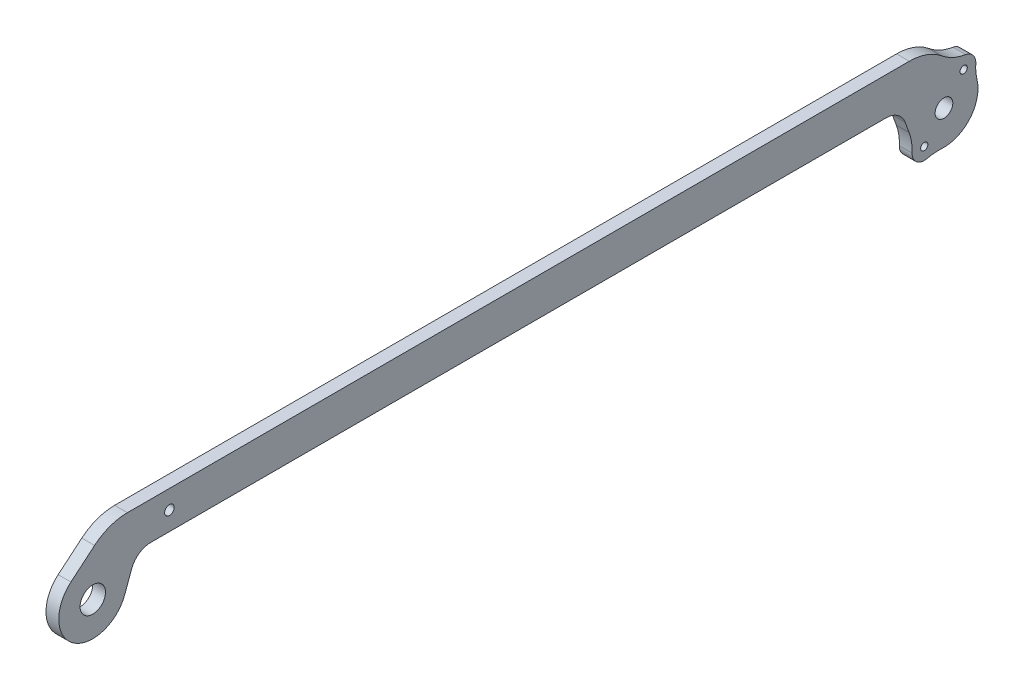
ISO-10303-21;
HEADER;
FILE_DESCRIPTION(('STEP AP214'),'2;1');
FILE_NAME('part.step','',(''),(''),'','','');
FILE_SCHEMA(('AUTOMOTIVE_DESIGN { 1 0 10303 214 1 1 1 1 }'));
ENDSEC;
DATA;
#1=APPLICATION_CONTEXT('core data for automotive mechanical design processes');
#2=APPLICATION_PROTOCOL_DEFINITION('international standard','automotive_design',2000,#1);
#3=PRODUCT_CONTEXT('',#1,'mechanical');
#4=PRODUCT('Part','Part','',(#3));
#5=PRODUCT_RELATED_PRODUCT_CATEGORY('part','',(#4));
#6=PRODUCT_DEFINITION_FORMATION('','',#4);
#7=PRODUCT_DEFINITION_CONTEXT('part definition',#1,'design');
#8=PRODUCT_DEFINITION('design','',#6,#7);
#9=PRODUCT_DEFINITION_SHAPE('','',#8);
#10=(LENGTH_UNIT() NAMED_UNIT(*) SI_UNIT(.MILLI.,.METRE.));
#11=(NAMED_UNIT(*) PLANE_ANGLE_UNIT() SI_UNIT($,.RADIAN.));
#12=(NAMED_UNIT(*) SI_UNIT($,.STERADIAN.) SOLID_ANGLE_UNIT());
#13=UNCERTAINTY_MEASURE_WITH_UNIT(LENGTH_MEASURE(1.E-05),#10,'distance_accuracy_value','');
#14=(GEOMETRIC_REPRESENTATION_CONTEXT(3) GLOBAL_UNCERTAINTY_ASSIGNED_CONTEXT((#13)) GLOBAL_UNIT_ASSIGNED_CONTEXT((#10,
#11,#12)) REPRESENTATION_CONTEXT('',''));
#15=CARTESIAN_POINT('',(0.,0.,0.));
#16=DIRECTION('',(0.,0.,1.));
#17=DIRECTION('',(1.,0.,0.));
#18=AXIS2_PLACEMENT_3D('',#15,#16,#17);
#19=CARTESIAN_POINT('',(4.7625,0.,-317.5));
#20=DIRECTION('',(-1.,0.,0.));
#21=DIRECTION('',(0.,0.,1.));
#22=AXIS2_PLACEMENT_3D('',#19,#20,#21);
#23=CYLINDRICAL_SURFACE('',#22,12.7);
#24=DIRECTION('',(1.,0.,0.));
#25=VECTOR('',#24,1.);
#26=CARTESIAN_POINT('',(-19.6871358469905,-12.677440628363,-316.743363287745));
#27=LINE('',#26,#25);
#28=CARTESIAN_POINT('',(0.,-12.677440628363,-316.743363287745));
#29=VERTEX_POINT('',#28);
#30=CARTESIAN_POINT('',(4.7625,-12.677440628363,-316.743363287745));
#31=VERTEX_POINT('',#30);
#32=EDGE_CURVE('E195',#29,#31,#27,.T.);
#33=ORIENTED_EDGE('',*,*,#32,.F.);
#34=CARTESIAN_POINT('',(0.,0.,-317.5));
#35=DIRECTION('',(1.,0.,0.));
#36=DIRECTION('',(0.,0.,-1.));
#37=AXIS2_PLACEMENT_3D('',#34,#35,#36);
#38=CIRCLE('',#37,12.7);
#39=CARTESIAN_POINT('',(0.,2.94655616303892,-329.853453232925));
#40=VERTEX_POINT('',#39);
#41=EDGE_CURVE('E289',#29,#40,#38,.T.);
#42=ORIENTED_EDGE('',*,*,#41,.T.);
#43=DIRECTION('',(1.,0.,0.));
#44=VECTOR('',#43,1.);
#45=CARTESIAN_POINT('',(-19.6871358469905,2.94655616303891,-329.853453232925));
#46=LINE('',#45,#44);
#47=CARTESIAN_POINT('',(4.7625,2.94655616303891,-329.853453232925));
#48=VERTEX_POINT('',#47);
#49=EDGE_CURVE('E227',#40,#48,#46,.T.);
#50=ORIENTED_EDGE('',*,*,#49,.T.);
#51=CARTESIAN_POINT('',(4.7625,0.,-317.5));
#52=DIRECTION('',(1.,0.,0.));
#53=DIRECTION('',(0.,0.,-1.));
#54=AXIS2_PLACEMENT_3D('',#51,#52,#53);
#55=CIRCLE('',#54,12.7);
#56=EDGE_CURVE('E270',#31,#48,#55,.T.);
#57=ORIENTED_EDGE('',*,*,#56,.F.);
#58=EDGE_LOOP('',(#33,#42,#50,#57));
#59=FACE_BOUND('',#58,.T.);
#60=ADVANCED_FACE('F60',(#59),#23,.T.);
#61=CARTESIAN_POINT('',(4.7625,0.,-21.6240923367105));
#62=DIRECTION('',(-1.,0.,0.));
#63=DIRECTION('',(0.,0.,1.));
#64=AXIS2_PLACEMENT_3D('',#61,#62,#63);
#65=PLANE('',#64);
#66=CARTESIAN_POINT('',(4.7625,14.605,-28.575));
#67=DIRECTION('',(1.,0.,0.));
#68=DIRECTION('',(0.,0.,-1.));
#69=AXIS2_PLACEMENT_3D('',#66,#67,#68);
#70=CIRCLE('',#69,1.778);
#71=CARTESIAN_POINT('',(4.7625,14.605,-30.353));
#72=VERTEX_POINT('',#71);
#73=EDGE_CURVE('E469',#72,#72,#70,.T.);
#74=ORIENTED_EDGE('',*,*,#73,.F.);
#75=EDGE_LOOP('',(#74));
#76=FACE_BOUND('',#75,.T.);
#77=CARTESIAN_POINT('',(4.7625,8.75588798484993,-324.847062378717));
#78=DIRECTION('',(1.,0.,0.));
#79=DIRECTION('',(0.,0.,-1.));
#80=AXIS2_PLACEMENT_3D('',#77,#78,#79);
#81=CIRCLE('',#80,1.35255000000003);
#82=CARTESIAN_POINT('',(4.7625,8.75588798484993,-326.199612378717));
#83=VERTEX_POINT('',#82);
#84=EDGE_CURVE('E215',#83,#83,#81,.T.);
#85=ORIENTED_EDGE('',*,*,#84,.F.);
#86=EDGE_LOOP('',(#85));
#87=FACE_BOUND('',#86,.T.);
#88=CARTESIAN_POINT('',(4.7625,-8.75588798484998,-310.152937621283));
#89=DIRECTION('',(1.,0.,0.));
#90=DIRECTION('',(0.,0.,-1.));
#91=AXIS2_PLACEMENT_3D('',#88,#89,#90);
#92=CIRCLE('',#91,1.35255000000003);
#93=CARTESIAN_POINT('',(4.7625,-8.75588798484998,-311.505487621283));
#94=VERTEX_POINT('',#93);
#95=EDGE_CURVE('E363',#94,#94,#92,.T.);
#96=ORIENTED_EDGE('',*,*,#95,.F.);
#97=EDGE_LOOP('',(#96));
#98=FACE_BOUND('',#97,.T.);
#99=DIRECTION('',(0.,0.,1.));
#100=VECTOR('',#99,1.);
#101=CARTESIAN_POINT('',(4.7625,21.59,-5.97226746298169));
#102=LINE('',#101,#100);
#103=CARTESIAN_POINT('',(4.7625,21.59,-304.59808975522));
#104=VERTEX_POINT('',#103);
#105=CARTESIAN_POINT('',(4.7625,21.59,-12.9059004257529));
#106=VERTEX_POINT('',#105);
#107=EDGE_CURVE('E272',#104,#106,#102,.T.);
#108=ORIENTED_EDGE('',*,*,#107,.T.);
#109=CARTESIAN_POINT('',(4.7625,2.54,-12.9059004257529));
#110=DIRECTION('',(-1.,0.,0.));
#111=DIRECTION('',(0.,0.,1.));
#112=AXIS2_PLACEMENT_3D('',#109,#110,#111);
#113=CIRCLE('',#112,19.05);
#114=CARTESIAN_POINT('',(4.7625,17.1331466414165,-0.660796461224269));
#115=VERTEX_POINT('',#114);
#116=EDGE_CURVE('E68',#106,#115,#113,.F.);
#117=ORIENTED_EDGE('',*,*,#116,.T.);
#118=DIRECTION('',(0.,-0.642787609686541,0.766044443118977));
#119=VECTOR('',#118,1.);
#120=CARTESIAN_POINT('',(4.7625,9.72876442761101,8.16340264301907));
#121=LINE('',#120,#119);
#122=CARTESIAN_POINT('',(4.7625,9.728764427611,8.16340264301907));
#123=VERTEX_POINT('',#122);
#124=EDGE_CURVE('E274',#115,#123,#121,.T.);
#125=ORIENTED_EDGE('',*,*,#124,.T.);
#126=CARTESIAN_POINT('',(4.7625,0.,0.));
#127=DIRECTION('',(1.,0.,0.));
#128=DIRECTION('',(0.,0.,-1.));
#129=AXIS2_PLACEMENT_3D('',#126,#127,#128);
#130=CIRCLE('',#129,12.7);
#131=CARTESIAN_POINT('',(4.7625,-4.343655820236,-11.934096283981));
#132=VERTEX_POINT('',#131);
#133=EDGE_CURVE('E276',#123,#132,#130,.T.);
#134=ORIENTED_EDGE('',*,*,#133,.T.);
#135=DIRECTION('',(0.,0.939692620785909,-0.342020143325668));
#136=VECTOR('',#135,1.);
#137=CARTESIAN_POINT('',(4.7625,-4.343655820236,-11.934096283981));
#138=LINE('',#137,#136);
#139=CARTESIAN_POINT('',(4.7625,2.6061934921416,-14.4636345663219));
#140=VERTEX_POINT('',#139);
#141=EDGE_CURVE('E278',#132,#140,#138,.T.);
#142=ORIENTED_EDGE('',*,*,#141,.T.);
#143=CARTESIAN_POINT('',(4.7625,0.,-21.6240923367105));
#144=DIRECTION('',(-1.,0.,0.));
#145=DIRECTION('',(0.,0.,1.));
#146=AXIS2_PLACEMENT_3D('',#143,#144,#145);
#147=CIRCLE('',#146,7.62);
#148=CARTESIAN_POINT('',(4.7625,7.62,-21.6240923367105));
#149=VERTEX_POINT('',#148);
#150=EDGE_CURVE('E259',#140,#149,#147,.T.);
#151=ORIENTED_EDGE('',*,*,#150,.T.);
#152=DIRECTION('',(0.,0.,-1.));
#153=VECTOR('',#152,1.);
#154=CARTESIAN_POINT('',(4.7625,7.62,-21.6240923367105));
#155=LINE('',#154,#153);
#156=CARTESIAN_POINT('',(4.7625,7.62000000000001,-295.875907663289));
#157=VERTEX_POINT('',#156);
#158=EDGE_CURVE('E262',#149,#157,#155,.T.);
#159=ORIENTED_EDGE('',*,*,#158,.T.);
#160=CARTESIAN_POINT('',(4.7625,0.,-295.875907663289));
#161=DIRECTION('',(-1.,0.,0.));
#162=DIRECTION('',(0.,0.,1.));
#163=AXIS2_PLACEMENT_3D('',#160,#161,#162);
#164=CIRCLE('',#163,7.62000000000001);
#165=CARTESIAN_POINT('',(4.7625,2.6061934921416,-303.036365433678));
#166=VERTEX_POINT('',#165);
#167=EDGE_CURVE('E265',#157,#166,#164,.T.);
#168=ORIENTED_EDGE('',*,*,#167,.T.);
#169=DIRECTION('',(0.,-0.939692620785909,-0.342020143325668));
#170=VECTOR('',#169,1.);
#171=CARTESIAN_POINT('',(4.7625,2.6061934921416,-303.036365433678));
#172=LINE('',#171,#170);
#173=CARTESIAN_POINT('',(4.7625,-1.39253114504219,-304.49178217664));
#174=VERTEX_POINT('',#173);
#175=EDGE_CURVE('E267',#166,#174,#172,.T.);
#176=ORIENTED_EDGE('',*,*,#175,.T.);
#177=CARTESIAN_POINT('',(4.7625,-7.90801487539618,-286.590637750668));
#178=DIRECTION('',(1.,0.,0.));
#179=DIRECTION('',(0.,0.,-1.));
#180=AXIS2_PLACEMENT_3D('',#177,#178,#179);
#181=CIRCLE('',#180,19.05);
#182=CARTESIAN_POINT('',(4.7625,-8.59307259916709,-305.628316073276));
#183=VERTEX_POINT('',#182);
#184=EDGE_CURVE('E206',#183,#174,#181,.T.);
#185=ORIENTED_EDGE('',*,*,#184,.F.);
#186=CARTESIAN_POINT('',(4.7625,-8.75588798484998,-310.152937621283));
#187=DIRECTION('',(1.,0.,0.));
#188=DIRECTION('',(0.,0.,-1.));
#189=AXIS2_PLACEMENT_3D('',#186,#187,#188);
#190=CIRCLE('',#189,4.52755000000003);
#191=CARTESIAN_POINT('',(4.7625,-13.1605714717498,-311.200540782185));
#192=VERTEX_POINT('',#191);
#193=EDGE_CURVE('E202',#183,#192,#190,.T.);
#194=ORIENTED_EDGE('',*,*,#193,.T.);
#195=CARTESIAN_POINT('',(4.7625,-31.6936015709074,-315.608408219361));
#196=DIRECTION('',(1.,0.,0.));
#197=DIRECTION('',(0.,0.,-1.));
#198=AXIS2_PLACEMENT_3D('',#195,#196,#197);
#199=CIRCLE('',#198,19.05);
#200=EDGE_CURVE('E212',#192,#31,#199,.F.);
#201=ORIENTED_EDGE('',*,*,#200,.T.);
#202=ORIENTED_EDGE('',*,*,#56,.T.);
#203=CARTESIAN_POINT('',(4.7625,7.36639040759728,-348.383633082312));
#204=DIRECTION('',(1.,0.,0.));
#205=DIRECTION('',(0.,0.,-1.));
#206=AXIS2_PLACEMENT_3D('',#203,#204,#205);
#207=CIRCLE('',#206,19.05);
#208=CARTESIAN_POINT('',(4.7625,8.48906553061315,-329.36674320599));
#209=VERTEX_POINT('',#208);
#210=EDGE_CURVE('E229',#209,#48,#207,.T.);
#211=ORIENTED_EDGE('',*,*,#210,.F.);
#212=CARTESIAN_POINT('',(4.7625,8.75588798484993,-324.847062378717));
#213=DIRECTION('',(1.,0.,0.));
#214=DIRECTION('',(0.,0.,-1.));
#215=AXIS2_PLACEMENT_3D('',#212,#213,#214);
#216=CIRCLE('',#215,4.52755000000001);
#217=CARTESIAN_POINT('',(4.7625,13.2210391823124,-325.596151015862));
#218=VERTEX_POINT('',#217);
#219=EDGE_CURVE('E224',#209,#218,#216,.T.);
#220=ORIENTED_EDGE('',*,*,#219,.T.);
#221=CARTESIAN_POINT('',(4.7625,32.0084916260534,-328.747996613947));
#222=DIRECTION('',(1.,0.,0.));
#223=DIRECTION('',(0.,0.,-1.));
#224=AXIS2_PLACEMENT_3D('',#221,#222,#223);
#225=CIRCLE('',#224,19.05);
#226=CARTESIAN_POINT('',(4.7625,17.2742458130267,-316.673043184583));
#227=VERTEX_POINT('',#226);
#228=EDGE_CURVE('E228',#218,#227,#225,.F.);
#229=ORIENTED_EDGE('',*,*,#228,.T.);
#230=CARTESIAN_POINT('',(4.7625,2.54000000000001,-304.59808975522));
#231=DIRECTION('',(-1.,0.,0.));
#232=DIRECTION('',(0.,0.,1.));
#233=AXIS2_PLACEMENT_3D('',#230,#231,#232);
#234=CIRCLE('',#233,19.05);
#235=EDGE_CURVE('E326',#227,#104,#234,.F.);
#236=ORIENTED_EDGE('',*,*,#235,.T.);
#237=EDGE_LOOP('',(#108,#117,#125,#134,#142,#151,#159,#168,#176,#185,#194,#201,#202,#211,#220,
#229,#236));
#238=FACE_BOUND('',#237,.T.);
#239=CARTESIAN_POINT('',(4.7625,0.,0.));
#240=DIRECTION('',(1.,0.,0.));
#241=DIRECTION('',(0.,0.,-1.));
#242=AXIS2_PLACEMENT_3D('',#239,#240,#241);
#243=CIRCLE('',#242,4.7371);
#244=CARTESIAN_POINT('',(4.7625,0.,4.7371));
#245=VERTEX_POINT('',#244);
#246=EDGE_CURVE('E253',#245,#245,#243,.T.);
#247=ORIENTED_EDGE('',*,*,#246,.F.);
#248=EDGE_LOOP('',(#247));
#249=FACE_BOUND('',#248,.T.);
#250=CARTESIAN_POINT('',(4.7625,0.,-317.5));
#251=DIRECTION('',(1.,0.,0.));
#252=DIRECTION('',(0.,0.,-1.));
#253=AXIS2_PLACEMENT_3D('',#250,#251,#252);
#254=CIRCLE('',#253,3.30200000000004);
#255=CARTESIAN_POINT('',(4.7625,0.,-314.198));
#256=VERTEX_POINT('',#255);
#257=EDGE_CURVE('E247',#256,#256,#254,.T.);
#258=ORIENTED_EDGE('',*,*,#257,.F.);
#259=EDGE_LOOP('',(#258));
#260=FACE_BOUND('',#259,.T.);
#261=ADVANCED_FACE('F330',(#76,#87,#98,#238,#249,#260),#65,.F.);
#262=CARTESIAN_POINT('',(0.,0.,-21.6240923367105));
#263=DIRECTION('',(-1.,0.,0.));
#264=DIRECTION('',(0.,0.,1.));
#265=AXIS2_PLACEMENT_3D('',#262,#263,#264);
#266=PLANE('',#265);
#267=CARTESIAN_POINT('',(0.,14.605,-28.575));
#268=DIRECTION('',(1.,0.,0.));
#269=DIRECTION('',(0.,0.,-1.));
#270=AXIS2_PLACEMENT_3D('',#267,#268,#269);
#271=CIRCLE('',#270,1.778);
#272=CARTESIAN_POINT('',(0.,14.605,-30.353));
#273=VERTEX_POINT('',#272);
#274=EDGE_CURVE('E460',#273,#273,#271,.T.);
#275=ORIENTED_EDGE('',*,*,#274,.T.);
#276=EDGE_LOOP('',(#275));
#277=FACE_BOUND('',#276,.T.);
#278=CARTESIAN_POINT('',(0.,8.75588798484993,-324.847062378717));
#279=DIRECTION('',(1.,0.,0.));
#280=DIRECTION('',(0.,0.,-1.));
#281=AXIS2_PLACEMENT_3D('',#278,#279,#280);
#282=CIRCLE('',#281,1.35255000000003);
#283=CARTESIAN_POINT('',(0.,8.75588798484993,-326.199612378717));
#284=VERTEX_POINT('',#283);
#285=EDGE_CURVE('E210',#284,#284,#282,.T.);
#286=ORIENTED_EDGE('',*,*,#285,.T.);
#287=EDGE_LOOP('',(#286));
#288=FACE_BOUND('',#287,.T.);
#289=CARTESIAN_POINT('',(0.,-8.75588798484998,-310.152937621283));
#290=DIRECTION('',(1.,0.,0.));
#291=DIRECTION('',(0.,0.,-1.));
#292=AXIS2_PLACEMENT_3D('',#289,#290,#291);
#293=CIRCLE('',#292,1.35255000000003);
#294=CARTESIAN_POINT('',(0.,-8.75588798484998,-311.505487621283));
#295=VERTEX_POINT('',#294);
#296=EDGE_CURVE('E464',#295,#295,#293,.T.);
#297=ORIENTED_EDGE('',*,*,#296,.T.);
#298=EDGE_LOOP('',(#297));
#299=FACE_BOUND('',#298,.T.);
#300=DIRECTION('',(0.,-0.642787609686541,0.766044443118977));
#301=VECTOR('',#300,1.);
#302=CARTESIAN_POINT('',(0.,9.72876442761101,8.16340264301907));
#303=LINE('',#302,#301);
#304=CARTESIAN_POINT('',(0.,17.1331466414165,-0.660796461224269));
#305=VERTEX_POINT('',#304);
#306=CARTESIAN_POINT('',(0.,9.728764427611,8.16340264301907));
#307=VERTEX_POINT('',#306);
#308=EDGE_CURVE('E293',#305,#307,#303,.T.);
#309=ORIENTED_EDGE('',*,*,#308,.F.);
#310=CARTESIAN_POINT('',(0.,2.54,-12.9059004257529));
#311=DIRECTION('',(-1.,0.,0.));
#312=DIRECTION('',(0.,0.,1.));
#313=AXIS2_PLACEMENT_3D('',#310,#311,#312);
#314=CIRCLE('',#313,19.05);
#315=CARTESIAN_POINT('',(0.,21.59,-12.9059004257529));
#316=VERTEX_POINT('',#315);
#317=EDGE_CURVE('E320',#305,#316,#314,.T.);
#318=ORIENTED_EDGE('',*,*,#317,.T.);
#319=DIRECTION('',(0.,0.,1.));
#320=VECTOR('',#319,1.);
#321=CARTESIAN_POINT('',(0.,21.59,-5.97226746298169));
#322=LINE('',#321,#320);
#323=CARTESIAN_POINT('',(0.,21.59,-304.59808975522));
#324=VERTEX_POINT('',#323);
#325=EDGE_CURVE('E291',#324,#316,#322,.T.);
#326=ORIENTED_EDGE('',*,*,#325,.F.);
#327=CARTESIAN_POINT('',(0.,2.54000000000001,-304.59808975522));
#328=DIRECTION('',(-1.,0.,0.));
#329=DIRECTION('',(0.,0.,1.));
#330=AXIS2_PLACEMENT_3D('',#327,#328,#329);
#331=CIRCLE('',#330,19.05);
#332=CARTESIAN_POINT('',(0.,17.2742458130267,-316.673043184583));
#333=VERTEX_POINT('',#332);
#334=EDGE_CURVE('E318',#324,#333,#331,.T.);
#335=ORIENTED_EDGE('',*,*,#334,.T.);
#336=CARTESIAN_POINT('',(0.,32.0084916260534,-328.747996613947));
#337=DIRECTION('',(-1.,0.,0.));
#338=DIRECTION('',(0.,0.,1.));
#339=AXIS2_PLACEMENT_3D('',#336,#337,#338);
#340=CIRCLE('',#339,19.05);
#341=CARTESIAN_POINT('',(0.,13.2210391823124,-325.596151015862));
#342=VERTEX_POINT('',#341);
#343=EDGE_CURVE('E235',#342,#333,#340,.T.);
#344=ORIENTED_EDGE('',*,*,#343,.F.);
#345=CARTESIAN_POINT('',(0.,8.75588798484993,-324.847062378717));
#346=DIRECTION('',(-1.,0.,0.));
#347=DIRECTION('',(0.,0.,1.));
#348=AXIS2_PLACEMENT_3D('',#345,#346,#347);
#349=CIRCLE('',#348,4.52755000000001);
#350=CARTESIAN_POINT('',(0.,8.48906553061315,-329.36674320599));
#351=VERTEX_POINT('',#350);
#352=EDGE_CURVE('E232',#351,#342,#349,.F.);
#353=ORIENTED_EDGE('',*,*,#352,.F.);
#354=CARTESIAN_POINT('',(0.,7.36639040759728,-348.383633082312));
#355=DIRECTION('',(-1.,0.,0.));
#356=DIRECTION('',(0.,0.,1.));
#357=AXIS2_PLACEMENT_3D('',#354,#355,#356);
#358=CIRCLE('',#357,19.05);
#359=EDGE_CURVE('E220',#351,#40,#358,.F.);
#360=ORIENTED_EDGE('',*,*,#359,.T.);
#361=ORIENTED_EDGE('',*,*,#41,.F.);
#362=CARTESIAN_POINT('',(0.,-31.6936015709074,-315.608408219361));
#363=DIRECTION('',(-1.,0.,0.));
#364=DIRECTION('',(0.,0.,1.));
#365=AXIS2_PLACEMENT_3D('',#362,#363,#364);
#366=CIRCLE('',#365,19.05);
#367=CARTESIAN_POINT('',(0.,-13.1605714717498,-311.200540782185));
#368=VERTEX_POINT('',#367);
#369=EDGE_CURVE('E192',#368,#29,#366,.T.);
#370=ORIENTED_EDGE('',*,*,#369,.F.);
#371=CARTESIAN_POINT('',(0.,-8.75588798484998,-310.152937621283));
#372=DIRECTION('',(-1.,0.,0.));
#373=DIRECTION('',(0.,0.,1.));
#374=AXIS2_PLACEMENT_3D('',#371,#372,#373);
#375=CIRCLE('',#374,4.52755000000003);
#376=CARTESIAN_POINT('',(0.,-8.59307259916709,-305.628316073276));
#377=VERTEX_POINT('',#376);
#378=EDGE_CURVE('E181',#377,#368,#375,.F.);
#379=ORIENTED_EDGE('',*,*,#378,.F.);
#380=CARTESIAN_POINT('',(0.,-7.90801487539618,-286.590637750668));
#381=DIRECTION('',(-1.,0.,0.));
#382=DIRECTION('',(0.,0.,1.));
#383=AXIS2_PLACEMENT_3D('',#380,#381,#382);
#384=CIRCLE('',#383,19.05);
#385=CARTESIAN_POINT('',(0.,-1.39253114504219,-304.49178217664));
#386=VERTEX_POINT('',#385);
#387=EDGE_CURVE('E188',#377,#386,#384,.F.);
#388=ORIENTED_EDGE('',*,*,#387,.T.);
#389=DIRECTION('',(0.,-0.939692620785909,-0.342020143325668));
#390=VECTOR('',#389,1.);
#391=CARTESIAN_POINT('',(0.,2.6061934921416,-303.036365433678));
#392=LINE('',#391,#390);
#393=CARTESIAN_POINT('',(0.,2.6061934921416,-303.036365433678));
#394=VERTEX_POINT('',#393);
#395=EDGE_CURVE('E287',#394,#386,#392,.T.);
#396=ORIENTED_EDGE('',*,*,#395,.F.);
#397=CARTESIAN_POINT('',(0.,0.,-295.875907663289));
#398=DIRECTION('',(-1.,0.,0.));
#399=DIRECTION('',(0.,0.,1.));
#400=AXIS2_PLACEMENT_3D('',#397,#398,#399);
#401=CIRCLE('',#400,7.62000000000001);
#402=CARTESIAN_POINT('',(0.,7.62000000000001,-295.875907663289));
#403=VERTEX_POINT('',#402);
#404=EDGE_CURVE('E285',#403,#394,#401,.T.);
#405=ORIENTED_EDGE('',*,*,#404,.F.);
#406=DIRECTION('',(0.,0.,-1.));
#407=VECTOR('',#406,1.);
#408=CARTESIAN_POINT('',(0.,7.62,-21.6240923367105));
#409=LINE('',#408,#407);
#410=CARTESIAN_POINT('',(0.,7.62,-21.6240923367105));
#411=VERTEX_POINT('',#410);
#412=EDGE_CURVE('E283',#411,#403,#409,.T.);
#413=ORIENTED_EDGE('',*,*,#412,.F.);
#414=CARTESIAN_POINT('',(0.,0.,-21.6240923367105));
#415=DIRECTION('',(-1.,0.,0.));
#416=DIRECTION('',(0.,0.,1.));
#417=AXIS2_PLACEMENT_3D('',#414,#415,#416);
#418=CIRCLE('',#417,7.62);
#419=CARTESIAN_POINT('',(0.,2.6061934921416,-14.4636345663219));
#420=VERTEX_POINT('',#419);
#421=EDGE_CURVE('E256',#420,#411,#418,.T.);
#422=ORIENTED_EDGE('',*,*,#421,.F.);
#423=DIRECTION('',(0.,0.939692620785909,-0.342020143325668));
#424=VECTOR('',#423,1.);
#425=CARTESIAN_POINT('',(0.,-4.343655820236,-11.934096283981));
#426=LINE('',#425,#424);
#427=CARTESIAN_POINT('',(0.,-4.343655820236,-11.934096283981));
#428=VERTEX_POINT('',#427);
#429=EDGE_CURVE('E263',#428,#420,#426,.T.);
#430=ORIENTED_EDGE('',*,*,#429,.F.);
#431=CARTESIAN_POINT('',(0.,0.,0.));
#432=DIRECTION('',(1.,0.,0.));
#433=DIRECTION('',(0.,0.,-1.));
#434=AXIS2_PLACEMENT_3D('',#431,#432,#433);
#435=CIRCLE('',#434,12.7);
#436=EDGE_CURVE('E295',#307,#428,#435,.T.);
#437=ORIENTED_EDGE('',*,*,#436,.F.);
#438=EDGE_LOOP('',(#309,#318,#326,#335,#344,#353,#360,#361,#370,#379,#388,#396,#405,#413,#422,
#430,#437));
#439=FACE_BOUND('',#438,.T.);
#440=CARTESIAN_POINT('',(0.,0.,0.));
#441=DIRECTION('',(1.,0.,0.));
#442=DIRECTION('',(0.,0.,-1.));
#443=AXIS2_PLACEMENT_3D('',#440,#441,#442);
#444=CIRCLE('',#443,4.7371);
#445=CARTESIAN_POINT('',(0.,0.,4.7371));
#446=VERTEX_POINT('',#445);
#447=EDGE_CURVE('E250',#446,#446,#444,.T.);
#448=ORIENTED_EDGE('',*,*,#447,.T.);
#449=EDGE_LOOP('',(#448));
#450=FACE_BOUND('',#449,.T.);
#451=CARTESIAN_POINT('',(0.,0.,-317.5));
#452=DIRECTION('',(1.,0.,0.));
#453=DIRECTION('',(0.,0.,-1.));
#454=AXIS2_PLACEMENT_3D('',#451,#452,#453);
#455=CIRCLE('',#454,3.30200000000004);
#456=CARTESIAN_POINT('',(0.,0.,-314.198));
#457=VERTEX_POINT('',#456);
#458=EDGE_CURVE('E237',#457,#457,#455,.T.);
#459=ORIENTED_EDGE('',*,*,#458,.T.);
#460=EDGE_LOOP('',(#459));
#461=FACE_BOUND('',#460,.T.);
#462=ADVANCED_FACE('F184',(#277,#288,#299,#439,#450,#461),#266,.T.);
#463=CARTESIAN_POINT('',(4.7625,0.,-21.6240923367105));
#464=DIRECTION('',(-1.,0.,0.));
#465=DIRECTION('',(0.,0.,1.));
#466=AXIS2_PLACEMENT_3D('',#463,#464,#465);
#467=CYLINDRICAL_SURFACE('',#466,7.62);
#468=ORIENTED_EDGE('',*,*,#421,.T.);
#469=DIRECTION('',(-1.,0.,0.));
#470=VECTOR('',#469,1.);
#471=CARTESIAN_POINT('',(4.7625,7.62,-21.6240923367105));
#472=LINE('',#471,#470);
#473=EDGE_CURVE('E312',#149,#411,#472,.T.);
#474=ORIENTED_EDGE('',*,*,#473,.F.);
#475=ORIENTED_EDGE('',*,*,#150,.F.);
#476=DIRECTION('',(-1.,0.,0.));
#477=VECTOR('',#476,1.);
#478=CARTESIAN_POINT('',(4.7625,2.6061934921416,-14.4636345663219));
#479=LINE('',#478,#477);
#480=EDGE_CURVE('E280',#140,#420,#479,.T.);
#481=ORIENTED_EDGE('',*,*,#480,.T.);
#482=EDGE_LOOP('',(#468,#474,#475,#481));
#483=FACE_BOUND('',#482,.T.);
#484=ADVANCED_FACE('F381',(#483),#467,.F.);
#485=CARTESIAN_POINT('',(4.7625,7.62,-21.6240923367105));
#486=DIRECTION('',(0.,1.,0.));
#487=DIRECTION('',(0.,0.,1.));
#488=AXIS2_PLACEMENT_3D('',#485,#486,#487);
#489=PLANE('',#488);
#490=ORIENTED_EDGE('',*,*,#412,.T.);
#491=DIRECTION('',(-1.,0.,0.));
#492=VECTOR('',#491,1.);
#493=CARTESIAN_POINT('',(4.7625,7.62000000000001,-295.875907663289));
#494=LINE('',#493,#492);
#495=EDGE_CURVE('E309',#157,#403,#494,.T.);
#496=ORIENTED_EDGE('',*,*,#495,.F.);
#497=ORIENTED_EDGE('',*,*,#158,.F.);
#498=ORIENTED_EDGE('',*,*,#473,.T.);
#499=EDGE_LOOP('',(#490,#496,#497,#498));
#500=FACE_BOUND('',#499,.T.);
#501=ADVANCED_FACE('F378',(#500),#489,.F.);
#502=CARTESIAN_POINT('',(4.7625,0.,-295.875907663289));
#503=DIRECTION('',(-1.,0.,0.));
#504=DIRECTION('',(0.,0.,1.));
#505=AXIS2_PLACEMENT_3D('',#502,#503,#504);
#506=CYLINDRICAL_SURFACE('',#505,7.62000000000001);
#507=ORIENTED_EDGE('',*,*,#404,.T.);
#508=DIRECTION('',(-1.,0.,0.));
#509=VECTOR('',#508,1.);
#510=CARTESIAN_POINT('',(4.7625,2.6061934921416,-303.036365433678));
#511=LINE('',#510,#509);
#512=EDGE_CURVE('E306',#166,#394,#511,.T.);
#513=ORIENTED_EDGE('',*,*,#512,.F.);
#514=ORIENTED_EDGE('',*,*,#167,.F.);
#515=ORIENTED_EDGE('',*,*,#495,.T.);
#516=EDGE_LOOP('',(#507,#513,#514,#515));
#517=FACE_BOUND('',#516,.T.);
#518=ADVANCED_FACE('F372',(#517),#506,.F.);
#519=CARTESIAN_POINT('',(4.7625,2.6061934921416,-303.036365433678));
#520=DIRECTION('',(0.,0.342020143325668,-0.939692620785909));
#521=DIRECTION('',(0.,0.939692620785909,0.342020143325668));
#522=AXIS2_PLACEMENT_3D('',#519,#520,#521);
#523=PLANE('',#522);
#524=ORIENTED_EDGE('',*,*,#395,.T.);
#525=DIRECTION('',(1.,0.,0.));
#526=VECTOR('',#525,1.);
#527=CARTESIAN_POINT('',(-19.6871358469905,-1.39253114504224,-304.49178217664));
#528=LINE('',#527,#526);
#529=EDGE_CURVE('E209',#386,#174,#528,.T.);
#530=ORIENTED_EDGE('',*,*,#529,.T.);
#531=ORIENTED_EDGE('',*,*,#175,.F.);
#532=ORIENTED_EDGE('',*,*,#512,.T.);
#533=EDGE_LOOP('',(#524,#530,#531,#532));
#534=FACE_BOUND('',#533,.T.);
#535=ADVANCED_FACE('F367',(#534),#523,.F.);
#536=CARTESIAN_POINT('',(4.7625,21.59,-5.97226746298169));
#537=DIRECTION('',(0.,-1.,0.));
#538=DIRECTION('',(0.,0.,-1.));
#539=AXIS2_PLACEMENT_3D('',#536,#537,#538);
#540=PLANE('',#539);
#541=ORIENTED_EDGE('',*,*,#325,.T.);
#542=DIRECTION('',(-1.,0.,0.));
#543=VECTOR('',#542,1.);
#544=CARTESIAN_POINT('',(4.7625,21.59,-12.9059004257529));
#545=LINE('',#544,#543);
#546=EDGE_CURVE('E81',#316,#106,#545,.F.);
#547=ORIENTED_EDGE('',*,*,#546,.T.);
#548=ORIENTED_EDGE('',*,*,#107,.F.);
#549=DIRECTION('',(-1.,0.,0.));
#550=VECTOR('',#549,1.);
#551=CARTESIAN_POINT('',(0.,21.59,-304.59808975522));
#552=LINE('',#551,#550);
#553=EDGE_CURVE('E322',#104,#324,#552,.T.);
#554=ORIENTED_EDGE('',*,*,#553,.T.);
#555=EDGE_LOOP('',(#541,#547,#548,#554));
#556=FACE_BOUND('',#555,.T.);
#557=ADVANCED_FACE('F341',(#556),#540,.F.);
#558=CARTESIAN_POINT('',(4.7625,9.72876442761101,8.16340264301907));
#559=DIRECTION('',(0.,-0.766044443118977,-0.642787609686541));
#560=DIRECTION('',(0.,0.642787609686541,-0.766044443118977));
#561=AXIS2_PLACEMENT_3D('',#558,#559,#560);
#562=PLANE('',#561);
#563=ORIENTED_EDGE('',*,*,#124,.F.);
#564=DIRECTION('',(-1.,0.,0.));
#565=VECTOR('',#564,1.);
#566=CARTESIAN_POINT('',(4.7625,17.1331466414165,-0.660796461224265));
#567=LINE('',#566,#565);
#568=EDGE_CURVE('E315',#115,#305,#567,.T.);
#569=ORIENTED_EDGE('',*,*,#568,.T.);
#570=ORIENTED_EDGE('',*,*,#308,.T.);
#571=DIRECTION('',(-1.,0.,0.));
#572=VECTOR('',#571,1.);
#573=CARTESIAN_POINT('',(4.7625,9.728764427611,8.16340264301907));
#574=LINE('',#573,#572);
#575=EDGE_CURVE('E303',#123,#307,#574,.T.);
#576=ORIENTED_EDGE('',*,*,#575,.F.);
#577=EDGE_LOOP('',(#563,#569,#570,#576));
#578=FACE_BOUND('',#577,.T.);
#579=ADVANCED_FACE('F336',(#578),#562,.F.);
#580=CARTESIAN_POINT('',(4.7625,0.,0.));
#581=DIRECTION('',(-1.,0.,0.));
#582=DIRECTION('',(0.,0.,1.));
#583=AXIS2_PLACEMENT_3D('',#580,#581,#582);
#584=CYLINDRICAL_SURFACE('',#583,12.7);
#585=ORIENTED_EDGE('',*,*,#436,.T.);
#586=DIRECTION('',(-1.,0.,0.));
#587=VECTOR('',#586,1.);
#588=CARTESIAN_POINT('',(4.7625,-4.343655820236,-11.934096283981));
#589=LINE('',#588,#587);
#590=EDGE_CURVE('E300',#132,#428,#589,.T.);
#591=ORIENTED_EDGE('',*,*,#590,.F.);
#592=ORIENTED_EDGE('',*,*,#133,.F.);
#593=ORIENTED_EDGE('',*,*,#575,.T.);
#594=EDGE_LOOP('',(#585,#591,#592,#593));
#595=FACE_BOUND('',#594,.T.);
#596=ADVANCED_FACE('F388',(#595),#584,.T.);
#597=CARTESIAN_POINT('',(4.7625,-4.343655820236,-11.934096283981));
#598=DIRECTION('',(0.,0.342020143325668,0.939692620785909));
#599=DIRECTION('',(0.,-0.939692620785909,0.342020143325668));
#600=AXIS2_PLACEMENT_3D('',#597,#598,#599);
#601=PLANE('',#600);
#602=ORIENTED_EDGE('',*,*,#429,.T.);
#603=ORIENTED_EDGE('',*,*,#480,.F.);
#604=ORIENTED_EDGE('',*,*,#141,.F.);
#605=ORIENTED_EDGE('',*,*,#590,.T.);
#606=EDGE_LOOP('',(#602,#603,#604,#605));
#607=FACE_BOUND('',#606,.T.);
#608=ADVANCED_FACE('F385',(#607),#601,.F.);
#609=CARTESIAN_POINT('',(4.7625,0.,0.));
#610=DIRECTION('',(-1.,0.,0.));
#611=DIRECTION('',(0.,0.,1.));
#612=AXIS2_PLACEMENT_3D('',#609,#610,#611);
#613=CYLINDRICAL_SURFACE('',#612,4.7371);
#614=CARTESIAN_POINT('',(4.7625,0.,4.7371));
#615=CARTESIAN_POINT('',(4.712890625,0.,4.7371));
#616=CARTESIAN_POINT('',(4.66328125,0.,4.7371));
#617=CARTESIAN_POINT('',(4.5640625,0.,4.7371));
#618=CARTESIAN_POINT('',(4.514453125,0.,4.7371));
#619=CARTESIAN_POINT('',(4.415234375,0.,4.7371));
#620=CARTESIAN_POINT('',(4.365625,0.,4.7371));
#621=CARTESIAN_POINT('',(4.26640625,0.,4.7371));
#622=CARTESIAN_POINT('',(4.216796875,0.,4.7371));
#623=CARTESIAN_POINT('',(4.117578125,0.,4.7371));
#624=CARTESIAN_POINT('',(4.06796875,0.,4.7371));
#625=CARTESIAN_POINT('',(3.96875,0.,4.7371));
#626=CARTESIAN_POINT('',(3.919140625,0.,4.7371));
#627=CARTESIAN_POINT('',(3.819921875,0.,4.7371));
#628=CARTESIAN_POINT('',(3.7703125,0.,4.7371));
#629=CARTESIAN_POINT('',(3.67109375,0.,4.7371));
#630=CARTESIAN_POINT('',(3.621484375,0.,4.7371));
#631=CARTESIAN_POINT('',(3.522265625,0.,4.7371));
#632=CARTESIAN_POINT('',(3.47265625,0.,4.7371));
#633=CARTESIAN_POINT('',(3.3734375,0.,4.7371));
#634=CARTESIAN_POINT('',(3.323828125,0.,4.7371));
#635=CARTESIAN_POINT('',(3.224609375,0.,4.7371));
#636=CARTESIAN_POINT('',(3.175,0.,4.7371));
#637=CARTESIAN_POINT('',(3.07578125,0.,4.7371));
#638=CARTESIAN_POINT('',(3.026171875,0.,4.7371));
#639=CARTESIAN_POINT('',(2.926953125,0.,4.7371));
#640=CARTESIAN_POINT('',(2.87734375,0.,4.7371));
#641=CARTESIAN_POINT('',(2.778125,0.,4.7371));
#642=CARTESIAN_POINT('',(2.728515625,0.,4.7371));
#643=CARTESIAN_POINT('',(2.629296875,0.,4.7371));
#644=CARTESIAN_POINT('',(2.5796875,0.,4.7371));
#645=CARTESIAN_POINT('',(2.48046875,0.,4.7371));
#646=CARTESIAN_POINT('',(2.430859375,0.,4.7371));
#647=CARTESIAN_POINT('',(2.331640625,0.,4.7371));
#648=CARTESIAN_POINT('',(2.28203125,0.,4.7371));
#649=CARTESIAN_POINT('',(2.1828125,0.,4.7371));
#650=CARTESIAN_POINT('',(2.133203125,0.,4.7371));
#651=CARTESIAN_POINT('',(2.033984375,0.,4.7371));
#652=CARTESIAN_POINT('',(1.984375,0.,4.7371));
#653=CARTESIAN_POINT('',(1.88515625,0.,4.7371));
#654=CARTESIAN_POINT('',(1.835546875,0.,4.7371));
#655=CARTESIAN_POINT('',(1.736328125,0.,4.7371));
#656=CARTESIAN_POINT('',(1.68671875,0.,4.7371));
#657=CARTESIAN_POINT('',(1.5875,0.,4.7371));
#658=CARTESIAN_POINT('',(1.537890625,0.,4.7371));
#659=CARTESIAN_POINT('',(1.438671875,0.,4.7371));
#660=CARTESIAN_POINT('',(1.3890625,0.,4.7371));
#661=CARTESIAN_POINT('',(1.28984375,0.,4.7371));
#662=CARTESIAN_POINT('',(1.240234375,0.,4.7371));
#663=CARTESIAN_POINT('',(1.141015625,0.,4.7371));
#664=CARTESIAN_POINT('',(1.09140625,0.,4.7371));
#665=CARTESIAN_POINT('',(0.992187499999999,0.,4.7371));
#666=CARTESIAN_POINT('',(0.942578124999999,0.,4.7371));
#667=CARTESIAN_POINT('',(0.843359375,0.,4.7371));
#668=CARTESIAN_POINT('',(0.79375,0.,4.7371));
#669=CARTESIAN_POINT('',(0.69453125,0.,4.7371));
#670=CARTESIAN_POINT('',(0.644921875,0.,4.7371));
#671=CARTESIAN_POINT('',(0.545703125,0.,4.7371));
#672=CARTESIAN_POINT('',(0.49609375,0.,4.7371));
#673=CARTESIAN_POINT('',(0.396875,0.,4.7371));
#674=CARTESIAN_POINT('',(0.347265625,0.,4.7371));
#675=CARTESIAN_POINT('',(0.248046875,0.,4.7371));
#676=CARTESIAN_POINT('',(0.1984375,0.,4.7371));
#677=CARTESIAN_POINT('',(0.09921875,0.,4.7371));
#678=CARTESIAN_POINT('',(0.049609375,0.,4.7371));
#679=CARTESIAN_POINT('',(0.,0.,4.7371));
#680=B_SPLINE_CURVE_WITH_KNOTS('',3,(#614,#615,#616,#617,#618,#619,#620,#621,#622,#623,#624,
#625,#626,#627,#628,#629,#630,#631,#632,#633,#634,#635,#636,#637,#638,#639,#640,#641,#642,#643,
#644,#645,#646,#647,#648,#649,#650,#651,#652,#653,#654,#655,#656,#657,#658,#659,#660,#661,#662,
#663,#664,#665,#666,#667,#668,#669,#670,#671,#672,#673,#674,#675,#676,#677,#678,#679),
.UNSPECIFIED.,.F.,.F.,(4,2,2,2,2,2,2,2,2,2,2,2,2,2,2,2,2,2,2,2,2,2,2,2,2,2,2,2,2,2,2,2,4),(0.,
0.148828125,0.29765625,0.446484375,0.5953125,0.744140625,0.892968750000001,1.041796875,1.190625,
1.339453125,1.48828125,1.637109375,1.7859375,1.934765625,2.08359375,2.232421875,2.38125,
2.530078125,2.67890625,2.827734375,2.9765625,3.125390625,3.27421875,3.423046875,3.571875,
3.720703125,3.86953125,4.018359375,4.1671875,4.316015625,4.46484375,4.613671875,4.7625),.UNSPECIFIED.);
#681=EDGE_CURVE('BSEAM395',#245,#446,#680,.T.);
#682=ORIENTED_EDGE('',*,*,#246,.T.);
#683=ORIENTED_EDGE('',*,*,#447,.F.);
#684=ORIENTED_EDGE('',*,*,#681,.T.);
#685=ORIENTED_EDGE('',*,*,#681,.F.);
#686=EDGE_LOOP('',(#682,#684,#683,#685));
#687=FACE_BOUND('',#686,.T.);
#688=ADVANCED_FACE('F395',(#687),#613,.F.);
#689=CARTESIAN_POINT('',(4.7625,0.,-317.5));
#690=DIRECTION('',(-1.,0.,0.));
#691=DIRECTION('',(0.,0.,1.));
#692=AXIS2_PLACEMENT_3D('',#689,#690,#691);
#693=CYLINDRICAL_SURFACE('',#692,3.30200000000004);
#694=CARTESIAN_POINT('',(4.7625,0.,-314.198));
#695=CARTESIAN_POINT('',(4.712890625,0.,-314.198));
#696=CARTESIAN_POINT('',(4.66328125,0.,-314.198));
#697=CARTESIAN_POINT('',(4.5640625,0.,-314.198));
#698=CARTESIAN_POINT('',(4.514453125,0.,-314.198));
#699=CARTESIAN_POINT('',(4.415234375,0.,-314.198));
#700=CARTESIAN_POINT('',(4.365625,0.,-314.198));
#701=CARTESIAN_POINT('',(4.26640625,0.,-314.198));
#702=CARTESIAN_POINT('',(4.216796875,0.,-314.198));
#703=CARTESIAN_POINT('',(4.117578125,0.,-314.198));
#704=CARTESIAN_POINT('',(4.06796875,0.,-314.198));
#705=CARTESIAN_POINT('',(3.96875,0.,-314.198));
#706=CARTESIAN_POINT('',(3.919140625,0.,-314.198));
#707=CARTESIAN_POINT('',(3.819921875,0.,-314.198));
#708=CARTESIAN_POINT('',(3.7703125,0.,-314.198));
#709=CARTESIAN_POINT('',(3.67109375,0.,-314.198));
#710=CARTESIAN_POINT('',(3.621484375,0.,-314.198));
#711=CARTESIAN_POINT('',(3.522265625,0.,-314.198));
#712=CARTESIAN_POINT('',(3.47265625,0.,-314.198));
#713=CARTESIAN_POINT('',(3.3734375,0.,-314.198));
#714=CARTESIAN_POINT('',(3.323828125,0.,-314.198));
#715=CARTESIAN_POINT('',(3.224609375,0.,-314.198));
#716=CARTESIAN_POINT('',(3.175,0.,-314.198));
#717=CARTESIAN_POINT('',(3.07578125,0.,-314.198));
#718=CARTESIAN_POINT('',(3.026171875,0.,-314.198));
#719=CARTESIAN_POINT('',(2.926953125,0.,-314.198));
#720=CARTESIAN_POINT('',(2.87734375,0.,-314.198));
#721=CARTESIAN_POINT('',(2.778125,0.,-314.198));
#722=CARTESIAN_POINT('',(2.728515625,0.,-314.198));
#723=CARTESIAN_POINT('',(2.629296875,0.,-314.198));
#724=CARTESIAN_POINT('',(2.5796875,0.,-314.198));
#725=CARTESIAN_POINT('',(2.48046875,0.,-314.198));
#726=CARTESIAN_POINT('',(2.430859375,0.,-314.198));
#727=CARTESIAN_POINT('',(2.331640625,0.,-314.198));
#728=CARTESIAN_POINT('',(2.28203125,0.,-314.198));
#729=CARTESIAN_POINT('',(2.1828125,0.,-314.198));
#730=CARTESIAN_POINT('',(2.133203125,0.,-314.198));
#731=CARTESIAN_POINT('',(2.033984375,0.,-314.198));
#732=CARTESIAN_POINT('',(1.984375,0.,-314.198));
#733=CARTESIAN_POINT('',(1.88515625,0.,-314.198));
#734=CARTESIAN_POINT('',(1.835546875,0.,-314.198));
#735=CARTESIAN_POINT('',(1.736328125,0.,-314.198));
#736=CARTESIAN_POINT('',(1.68671875,0.,-314.198));
#737=CARTESIAN_POINT('',(1.5875,0.,-314.198));
#738=CARTESIAN_POINT('',(1.537890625,0.,-314.198));
#739=CARTESIAN_POINT('',(1.438671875,0.,-314.198));
#740=CARTESIAN_POINT('',(1.3890625,0.,-314.198));
#741=CARTESIAN_POINT('',(1.28984375,0.,-314.198));
#742=CARTESIAN_POINT('',(1.240234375,0.,-314.198));
#743=CARTESIAN_POINT('',(1.141015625,0.,-314.198));
#744=CARTESIAN_POINT('',(1.09140625,0.,-314.198));
#745=CARTESIAN_POINT('',(0.9921875,0.,-314.198));
#746=CARTESIAN_POINT('',(0.942578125,0.,-314.198));
#747=CARTESIAN_POINT('',(0.843359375,0.,-314.198));
#748=CARTESIAN_POINT('',(0.79375,0.,-314.198));
#749=CARTESIAN_POINT('',(0.69453125,0.,-314.198));
#750=CARTESIAN_POINT('',(0.644921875,0.,-314.198));
#751=CARTESIAN_POINT('',(0.545703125,0.,-314.198));
#752=CARTESIAN_POINT('',(0.49609375,0.,-314.198));
#753=CARTESIAN_POINT('',(0.396875,0.,-314.198));
#754=CARTESIAN_POINT('',(0.347265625,0.,-314.198));
#755=CARTESIAN_POINT('',(0.248046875,0.,-314.198));
#756=CARTESIAN_POINT('',(0.1984375,0.,-314.198));
#757=CARTESIAN_POINT('',(0.09921875,0.,-314.198));
#758=CARTESIAN_POINT('',(0.049609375,0.,-314.198));
#759=CARTESIAN_POINT('',(0.,0.,-314.198));
#760=B_SPLINE_CURVE_WITH_KNOTS('',3,(#694,#695,#696,#697,#698,#699,#700,#701,#702,#703,#704,
#705,#706,#707,#708,#709,#710,#711,#712,#713,#714,#715,#716,#717,#718,#719,#720,#721,#722,#723,
#724,#725,#726,#727,#728,#729,#730,#731,#732,#733,#734,#735,#736,#737,#738,#739,#740,#741,#742,
#743,#744,#745,#746,#747,#748,#749,#750,#751,#752,#753,#754,#755,#756,#757,#758,#759),
.UNSPECIFIED.,.F.,.F.,(4,2,2,2,2,2,2,2,2,2,2,2,2,2,2,2,2,2,2,2,2,2,2,2,2,2,2,2,2,2,2,2,4),(0.,
0.148828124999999,0.297656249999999,0.446484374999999,0.595312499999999,0.744140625,0.89296875,
1.041796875,1.190625,1.339453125,1.48828125,1.637109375,1.7859375,1.934765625,2.08359375,
2.232421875,2.38125,2.530078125,2.67890625,2.827734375,2.9765625,3.125390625,3.27421875,
3.423046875,3.571875,3.720703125,3.86953125,4.018359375,4.1671875,4.316015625,4.46484375,
4.613671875,4.7625),.UNSPECIFIED.);
#761=EDGE_CURVE('BSEAM446',#256,#457,#760,.T.);
#762=ORIENTED_EDGE('',*,*,#257,.T.);
#763=ORIENTED_EDGE('',*,*,#458,.F.);
#764=ORIENTED_EDGE('',*,*,#761,.T.);
#765=ORIENTED_EDGE('',*,*,#761,.F.);
#766=EDGE_LOOP('',(#762,#764,#763,#765));
#767=FACE_BOUND('',#766,.T.);
#768=ADVANCED_FACE('F446',(#767),#693,.F.);
#769=CARTESIAN_POINT('',(-19.6871358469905,7.36639040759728,-348.383633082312));
#770=DIRECTION('',(1.,0.,0.));
#771=DIRECTION('',(0.,0.,-1.));
#772=AXIS2_PLACEMENT_3D('',#769,#770,#771);
#773=CYLINDRICAL_SURFACE('',#772,19.05);
#774=ORIENTED_EDGE('',*,*,#359,.F.);
#775=DIRECTION('',(1.,0.,0.));
#776=VECTOR('',#775,1.);
#777=CARTESIAN_POINT('',(-19.6871358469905,8.48906553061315,-329.36674320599));
#778=LINE('',#777,#776);
#779=EDGE_CURVE('E233',#351,#209,#778,.T.);
#780=ORIENTED_EDGE('',*,*,#779,.T.);
#781=ORIENTED_EDGE('',*,*,#210,.T.);
#782=ORIENTED_EDGE('',*,*,#49,.F.);
#783=EDGE_LOOP('',(#774,#780,#781,#782));
#784=FACE_BOUND('',#783,.T.);
#785=ADVANCED_FACE('F354',(#784),#773,.F.);
#786=CARTESIAN_POINT('',(-19.6871358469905,8.75588798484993,-324.847062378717));
#787=DIRECTION('',(1.,0.,0.));
#788=DIRECTION('',(0.,0.,-1.));
#789=AXIS2_PLACEMENT_3D('',#786,#787,#788);
#790=CYLINDRICAL_SURFACE('',#789,4.52755000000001);
#791=ORIENTED_EDGE('',*,*,#779,.F.);
#792=ORIENTED_EDGE('',*,*,#352,.T.);
#793=DIRECTION('',(1.,0.,0.));
#794=VECTOR('',#793,1.);
#795=CARTESIAN_POINT('',(-19.6871358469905,13.2210391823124,-325.596151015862));
#796=LINE('',#795,#794);
#797=EDGE_CURVE('E238',#342,#218,#796,.T.);
#798=ORIENTED_EDGE('',*,*,#797,.T.);
#799=ORIENTED_EDGE('',*,*,#219,.F.);
#800=EDGE_LOOP('',(#791,#792,#798,#799));
#801=FACE_BOUND('',#800,.T.);
#802=ADVANCED_FACE('F350',(#801),#790,.T.);
#803=CARTESIAN_POINT('',(-19.6871358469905,32.0084916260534,-328.747996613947));
#804=DIRECTION('',(1.,0.,0.));
#805=DIRECTION('',(0.,0.,-1.));
#806=AXIS2_PLACEMENT_3D('',#803,#804,#805);
#807=CYLINDRICAL_SURFACE('',#806,19.05);
#808=ORIENTED_EDGE('',*,*,#343,.T.);
#809=DIRECTION('',(1.,0.,0.));
#810=VECTOR('',#809,1.);
#811=CARTESIAN_POINT('',(-19.6871358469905,17.2742458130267,-316.673043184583));
#812=LINE('',#811,#810);
#813=EDGE_CURVE('E12',#333,#227,#812,.T.);
#814=ORIENTED_EDGE('',*,*,#813,.T.);
#815=ORIENTED_EDGE('',*,*,#228,.F.);
#816=ORIENTED_EDGE('',*,*,#797,.F.);
#817=EDGE_LOOP('',(#808,#814,#815,#816));
#818=FACE_BOUND('',#817,.T.);
#819=ADVANCED_FACE('F346',(#818),#807,.F.);
#820=CARTESIAN_POINT('',(-19.6871358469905,-7.90801487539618,-286.590637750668));
#821=DIRECTION('',(1.,0.,0.));
#822=DIRECTION('',(0.,0.,-1.));
#823=AXIS2_PLACEMENT_3D('',#820,#821,#822);
#824=CYLINDRICAL_SURFACE('',#823,19.05);
#825=ORIENTED_EDGE('',*,*,#387,.F.);
#826=DIRECTION('',(1.,0.,0.));
#827=VECTOR('',#826,1.);
#828=CARTESIAN_POINT('',(-19.6871358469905,-8.59307259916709,-305.628316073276));
#829=LINE('',#828,#827);
#830=EDGE_CURVE('E199',#377,#183,#829,.T.);
#831=ORIENTED_EDGE('',*,*,#830,.T.);
#832=ORIENTED_EDGE('',*,*,#184,.T.);
#833=ORIENTED_EDGE('',*,*,#529,.F.);
#834=EDGE_LOOP('',(#825,#831,#832,#833));
#835=FACE_BOUND('',#834,.T.);
#836=ADVANCED_FACE('F208',(#835),#824,.F.);
#837=CARTESIAN_POINT('',(-19.6871358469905,-8.75588798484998,-310.152937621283));
#838=DIRECTION('',(1.,0.,0.));
#839=DIRECTION('',(0.,0.,-1.));
#840=AXIS2_PLACEMENT_3D('',#837,#838,#839);
#841=CYLINDRICAL_SURFACE('',#840,4.52755000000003);
#842=ORIENTED_EDGE('',*,*,#830,.F.);
#843=ORIENTED_EDGE('',*,*,#378,.T.);
#844=DIRECTION('',(1.,0.,0.));
#845=VECTOR('',#844,1.);
#846=CARTESIAN_POINT('',(-19.6871358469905,-13.1605714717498,-311.200540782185));
#847=LINE('',#846,#845);
#848=EDGE_CURVE('E196',#368,#192,#847,.T.);
#849=ORIENTED_EDGE('',*,*,#848,.T.);
#850=ORIENTED_EDGE('',*,*,#193,.F.);
#851=EDGE_LOOP('',(#842,#843,#849,#850));
#852=FACE_BOUND('',#851,.T.);
#853=ADVANCED_FACE('F200',(#852),#841,.T.);
#854=CARTESIAN_POINT('',(-19.6871358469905,-31.6936015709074,-315.608408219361));
#855=DIRECTION('',(1.,0.,0.));
#856=DIRECTION('',(0.,0.,-1.));
#857=AXIS2_PLACEMENT_3D('',#854,#855,#856);
#858=CYLINDRICAL_SURFACE('',#857,19.05);
#859=ORIENTED_EDGE('',*,*,#848,.F.);
#860=ORIENTED_EDGE('',*,*,#369,.T.);
#861=ORIENTED_EDGE('',*,*,#32,.T.);
#862=ORIENTED_EDGE('',*,*,#200,.F.);
#863=EDGE_LOOP('',(#859,#860,#861,#862));
#864=FACE_BOUND('',#863,.T.);
#865=ADVANCED_FACE('F427',(#864),#858,.F.);
#866=CARTESIAN_POINT('',(0.,-8.75588798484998,-310.152937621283));
#867=DIRECTION('',(1.,0.,0.));
#868=DIRECTION('',(0.,0.,-1.));
#869=AXIS2_PLACEMENT_3D('',#866,#867,#868);
#870=CYLINDRICAL_SURFACE('',#869,1.35255000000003);
#871=CARTESIAN_POINT('',(0.,-8.75588798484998,-311.505487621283));
#872=CARTESIAN_POINT('',(0.049609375,-8.75588798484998,-311.505487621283));
#873=CARTESIAN_POINT('',(0.09921875,-8.75588798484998,-311.505487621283));
#874=CARTESIAN_POINT('',(0.1984375,-8.75588798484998,-311.505487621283));
#875=CARTESIAN_POINT('',(0.248046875,-8.75588798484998,-311.505487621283));
#876=CARTESIAN_POINT('',(0.347265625,-8.75588798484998,-311.505487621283));
#877=CARTESIAN_POINT('',(0.396875,-8.75588798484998,-311.505487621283));
#878=CARTESIAN_POINT('',(0.49609375,-8.75588798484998,-311.505487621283));
#879=CARTESIAN_POINT('',(0.545703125,-8.75588798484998,-311.505487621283));
#880=CARTESIAN_POINT('',(0.644921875,-8.75588798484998,-311.505487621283));
#881=CARTESIAN_POINT('',(0.69453125,-8.75588798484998,-311.505487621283));
#882=CARTESIAN_POINT('',(0.79375,-8.75588798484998,-311.505487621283));
#883=CARTESIAN_POINT('',(0.843359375,-8.75588798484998,-311.505487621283));
#884=CARTESIAN_POINT('',(0.942578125,-8.75588798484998,-311.505487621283));
#885=CARTESIAN_POINT('',(0.9921875,-8.75588798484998,-311.505487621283));
#886=CARTESIAN_POINT('',(1.09140625,-8.75588798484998,-311.505487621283));
#887=CARTESIAN_POINT('',(1.141015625,-8.75588798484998,-311.505487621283));
#888=CARTESIAN_POINT('',(1.240234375,-8.75588798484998,-311.505487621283));
#889=CARTESIAN_POINT('',(1.28984375,-8.75588798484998,-311.505487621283));
#890=CARTESIAN_POINT('',(1.3890625,-8.75588798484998,-311.505487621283));
#891=CARTESIAN_POINT('',(1.438671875,-8.75588798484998,-311.505487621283));
#892=CARTESIAN_POINT('',(1.537890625,-8.75588798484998,-311.505487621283));
#893=CARTESIAN_POINT('',(1.5875,-8.75588798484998,-311.505487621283));
#894=CARTESIAN_POINT('',(1.68671875,-8.75588798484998,-311.505487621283));
#895=CARTESIAN_POINT('',(1.736328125,-8.75588798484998,-311.505487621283));
#896=CARTESIAN_POINT('',(1.835546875,-8.75588798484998,-311.505487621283));
#897=CARTESIAN_POINT('',(1.88515625,-8.75588798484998,-311.505487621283));
#898=CARTESIAN_POINT('',(1.984375,-8.75588798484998,-311.505487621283));
#899=CARTESIAN_POINT('',(2.033984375,-8.75588798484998,-311.505487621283));
#900=CARTESIAN_POINT('',(2.133203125,-8.75588798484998,-311.505487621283));
#901=CARTESIAN_POINT('',(2.1828125,-8.75588798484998,-311.505487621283));
#902=CARTESIAN_POINT('',(2.28203125,-8.75588798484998,-311.505487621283));
#903=CARTESIAN_POINT('',(2.331640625,-8.75588798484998,-311.505487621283));
#904=CARTESIAN_POINT('',(2.430859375,-8.75588798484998,-311.505487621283));
#905=CARTESIAN_POINT('',(2.48046875,-8.75588798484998,-311.505487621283));
#906=CARTESIAN_POINT('',(2.5796875,-8.75588798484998,-311.505487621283));
#907=CARTESIAN_POINT('',(2.629296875,-8.75588798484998,-311.505487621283));
#908=CARTESIAN_POINT('',(2.728515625,-8.75588798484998,-311.505487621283));
#909=CARTESIAN_POINT('',(2.778125,-8.75588798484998,-311.505487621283));
#910=CARTESIAN_POINT('',(2.87734375,-8.75588798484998,-311.505487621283));
#911=CARTESIAN_POINT('',(2.926953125,-8.75588798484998,-311.505487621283));
#912=CARTESIAN_POINT('',(3.026171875,-8.75588798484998,-311.505487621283));
#913=CARTESIAN_POINT('',(3.07578125,-8.75588798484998,-311.505487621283));
#914=CARTESIAN_POINT('',(3.175,-8.75588798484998,-311.505487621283));
#915=CARTESIAN_POINT('',(3.224609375,-8.75588798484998,-311.505487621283));
#916=CARTESIAN_POINT('',(3.323828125,-8.75588798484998,-311.505487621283));
#917=CARTESIAN_POINT('',(3.3734375,-8.75588798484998,-311.505487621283));
#918=CARTESIAN_POINT('',(3.47265625,-8.75588798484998,-311.505487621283));
#919=CARTESIAN_POINT('',(3.522265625,-8.75588798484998,-311.505487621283));
#920=CARTESIAN_POINT('',(3.621484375,-8.75588798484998,-311.505487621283));
#921=CARTESIAN_POINT('',(3.67109375,-8.75588798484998,-311.505487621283));
#922=CARTESIAN_POINT('',(3.7703125,-8.75588798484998,-311.505487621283));
#923=CARTESIAN_POINT('',(3.819921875,-8.75588798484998,-311.505487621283));
#924=CARTESIAN_POINT('',(3.919140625,-8.75588798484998,-311.505487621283));
#925=CARTESIAN_POINT('',(3.96875,-8.75588798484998,-311.505487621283));
#926=CARTESIAN_POINT('',(4.06796875,-8.75588798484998,-311.505487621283));
#927=CARTESIAN_POINT('',(4.117578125,-8.75588798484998,-311.505487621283));
#928=CARTESIAN_POINT('',(4.216796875,-8.75588798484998,-311.505487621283));
#929=CARTESIAN_POINT('',(4.26640625,-8.75588798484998,-311.505487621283));
#930=CARTESIAN_POINT('',(4.365625,-8.75588798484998,-311.505487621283));
#931=CARTESIAN_POINT('',(4.415234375,-8.75588798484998,-311.505487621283));
#932=CARTESIAN_POINT('',(4.514453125,-8.75588798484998,-311.505487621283));
#933=CARTESIAN_POINT('',(4.5640625,-8.75588798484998,-311.505487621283));
#934=CARTESIAN_POINT('',(4.66328125,-8.75588798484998,-311.505487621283));
#935=CARTESIAN_POINT('',(4.712890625,-8.75588798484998,-311.505487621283));
#936=CARTESIAN_POINT('',(4.7625,-8.75588798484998,-311.505487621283));
#937=B_SPLINE_CURVE_WITH_KNOTS('',3,(#871,#872,#873,#874,#875,#876,#877,#878,#879,#880,#881,
#882,#883,#884,#885,#886,#887,#888,#889,#890,#891,#892,#893,#894,#895,#896,#897,#898,#899,#900,
#901,#902,#903,#904,#905,#906,#907,#908,#909,#910,#911,#912,#913,#914,#915,#916,#917,#918,#919,
#920,#921,#922,#923,#924,#925,#926,#927,#928,#929,#930,#931,#932,#933,#934,#935,#936),
.UNSPECIFIED.,.F.,.F.,(4,2,2,2,2,2,2,2,2,2,2,2,2,2,2,2,2,2,2,2,2,2,2,2,2,2,2,2,2,2,2,2,4),(0.,
0.148828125,0.29765625,0.446484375,0.5953125,0.744140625,0.89296875,1.041796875,1.190625,
1.339453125,1.48828125,1.637109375,1.7859375,1.934765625,2.08359375,2.232421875,2.38125,
2.530078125,2.67890625,2.827734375,2.9765625,3.125390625,3.27421875,3.423046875,3.571875,
3.720703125,3.86953125,4.018359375,4.1671875,4.316015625,4.46484375,4.613671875,4.7625),.UNSPECIFIED.);
#938=EDGE_CURVE('BSEAM421',#295,#94,#937,.T.);
#939=ORIENTED_EDGE('',*,*,#296,.F.);
#940=ORIENTED_EDGE('',*,*,#95,.T.);
#941=ORIENTED_EDGE('',*,*,#938,.T.);
#942=ORIENTED_EDGE('',*,*,#938,.F.);
#943=EDGE_LOOP('',(#939,#941,#940,#942));
#944=FACE_BOUND('',#943,.T.);
#945=ADVANCED_FACE('F421',(#944),#870,.F.);
#946=CARTESIAN_POINT('',(0.,8.75588798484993,-324.847062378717));
#947=DIRECTION('',(1.,0.,0.));
#948=DIRECTION('',(0.,0.,-1.));
#949=AXIS2_PLACEMENT_3D('',#946,#947,#948);
#950=CYLINDRICAL_SURFACE('',#949,1.35255000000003);
#951=CARTESIAN_POINT('',(0.,8.75588798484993,-326.199612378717));
#952=CARTESIAN_POINT('',(0.049609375,8.75588798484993,-326.199612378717));
#953=CARTESIAN_POINT('',(0.09921875,8.75588798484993,-326.199612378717));
#954=CARTESIAN_POINT('',(0.1984375,8.75588798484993,-326.199612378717));
#955=CARTESIAN_POINT('',(0.248046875,8.75588798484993,-326.199612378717));
#956=CARTESIAN_POINT('',(0.347265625,8.75588798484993,-326.199612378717));
#957=CARTESIAN_POINT('',(0.396875,8.75588798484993,-326.199612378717));
#958=CARTESIAN_POINT('',(0.49609375,8.75588798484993,-326.199612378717));
#959=CARTESIAN_POINT('',(0.545703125,8.75588798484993,-326.199612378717));
#960=CARTESIAN_POINT('',(0.644921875,8.75588798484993,-326.199612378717));
#961=CARTESIAN_POINT('',(0.69453125,8.75588798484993,-326.199612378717));
#962=CARTESIAN_POINT('',(0.79375,8.75588798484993,-326.199612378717));
#963=CARTESIAN_POINT('',(0.843359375,8.75588798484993,-326.199612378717));
#964=CARTESIAN_POINT('',(0.942578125,8.75588798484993,-326.199612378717));
#965=CARTESIAN_POINT('',(0.9921875,8.75588798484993,-326.199612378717));
#966=CARTESIAN_POINT('',(1.09140625,8.75588798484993,-326.199612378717));
#967=CARTESIAN_POINT('',(1.141015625,8.75588798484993,-326.199612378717));
#968=CARTESIAN_POINT('',(1.240234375,8.75588798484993,-326.199612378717));
#969=CARTESIAN_POINT('',(1.28984375,8.75588798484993,-326.199612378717));
#970=CARTESIAN_POINT('',(1.3890625,8.75588798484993,-326.199612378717));
#971=CARTESIAN_POINT('',(1.438671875,8.75588798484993,-326.199612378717));
#972=CARTESIAN_POINT('',(1.537890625,8.75588798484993,-326.199612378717));
#973=CARTESIAN_POINT('',(1.5875,8.75588798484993,-326.199612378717));
#974=CARTESIAN_POINT('',(1.68671875,8.75588798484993,-326.199612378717));
#975=CARTESIAN_POINT('',(1.736328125,8.75588798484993,-326.199612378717));
#976=CARTESIAN_POINT('',(1.835546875,8.75588798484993,-326.199612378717));
#977=CARTESIAN_POINT('',(1.88515625,8.75588798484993,-326.199612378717));
#978=CARTESIAN_POINT('',(1.984375,8.75588798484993,-326.199612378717));
#979=CARTESIAN_POINT('',(2.033984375,8.75588798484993,-326.199612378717));
#980=CARTESIAN_POINT('',(2.133203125,8.75588798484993,-326.199612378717));
#981=CARTESIAN_POINT('',(2.1828125,8.75588798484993,-326.199612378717));
#982=CARTESIAN_POINT('',(2.28203125,8.75588798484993,-326.199612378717));
#983=CARTESIAN_POINT('',(2.331640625,8.75588798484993,-326.199612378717));
#984=CARTESIAN_POINT('',(2.430859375,8.75588798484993,-326.199612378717));
#985=CARTESIAN_POINT('',(2.48046875,8.75588798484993,-326.199612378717));
#986=CARTESIAN_POINT('',(2.5796875,8.75588798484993,-326.199612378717));
#987=CARTESIAN_POINT('',(2.629296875,8.75588798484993,-326.199612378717));
#988=CARTESIAN_POINT('',(2.728515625,8.75588798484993,-326.199612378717));
#989=CARTESIAN_POINT('',(2.778125,8.75588798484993,-326.199612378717));
#990=CARTESIAN_POINT('',(2.87734375,8.75588798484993,-326.199612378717));
#991=CARTESIAN_POINT('',(2.926953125,8.75588798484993,-326.199612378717));
#992=CARTESIAN_POINT('',(3.026171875,8.75588798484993,-326.199612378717));
#993=CARTESIAN_POINT('',(3.07578125,8.75588798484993,-326.199612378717));
#994=CARTESIAN_POINT('',(3.175,8.75588798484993,-326.199612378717));
#995=CARTESIAN_POINT('',(3.224609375,8.75588798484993,-326.199612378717));
#996=CARTESIAN_POINT('',(3.323828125,8.75588798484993,-326.199612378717));
#997=CARTESIAN_POINT('',(3.3734375,8.75588798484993,-326.199612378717));
#998=CARTESIAN_POINT('',(3.47265625,8.75588798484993,-326.199612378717));
#999=CARTESIAN_POINT('',(3.522265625,8.75588798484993,-326.199612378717));
#1000=CARTESIAN_POINT('',(3.621484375,8.75588798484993,-326.199612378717));
#1001=CARTESIAN_POINT('',(3.67109375,8.75588798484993,-326.199612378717));
#1002=CARTESIAN_POINT('',(3.7703125,8.75588798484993,-326.199612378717));
#1003=CARTESIAN_POINT('',(3.819921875,8.75588798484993,-326.199612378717));
#1004=CARTESIAN_POINT('',(3.919140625,8.75588798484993,-326.199612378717));
#1005=CARTESIAN_POINT('',(3.96875,8.75588798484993,-326.199612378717));
#1006=CARTESIAN_POINT('',(4.06796875,8.75588798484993,-326.199612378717));
#1007=CARTESIAN_POINT('',(4.117578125,8.75588798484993,-326.199612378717));
#1008=CARTESIAN_POINT('',(4.216796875,8.75588798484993,-326.199612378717));
#1009=CARTESIAN_POINT('',(4.26640625,8.75588798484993,-326.199612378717));
#1010=CARTESIAN_POINT('',(4.365625,8.75588798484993,-326.199612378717));
#1011=CARTESIAN_POINT('',(4.415234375,8.75588798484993,-326.199612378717));
#1012=CARTESIAN_POINT('',(4.514453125,8.75588798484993,-326.199612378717));
#1013=CARTESIAN_POINT('',(4.5640625,8.75588798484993,-326.199612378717));
#1014=CARTESIAN_POINT('',(4.66328125,8.75588798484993,-326.199612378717));
#1015=CARTESIAN_POINT('',(4.712890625,8.75588798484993,-326.199612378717));
#1016=CARTESIAN_POINT('',(4.7625,8.75588798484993,-326.199612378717));
#1017=B_SPLINE_CURVE_WITH_KNOTS('',3,(#951,#952,#953,#954,#955,#956,#957,#958,#959,#960,#961,
#962,#963,#964,#965,#966,#967,#968,#969,#970,#971,#972,#973,#974,#975,#976,#977,#978,#979,#980,
#981,#982,#983,#984,#985,#986,#987,#988,#989,#990,#991,#992,#993,#994,#995,#996,#997,#998,#999,
#1000,#1001,#1002,#1003,#1004,#1005,#1006,#1007,#1008,#1009,#1010,#1011,#1012,#1013,#1014,#1015,
#1016),.UNSPECIFIED.,.F.,.F.,(4,2,2,2,2,2,2,2,2,2,2,2,2,2,2,2,2,2,2,2,2,2,2,2,2,2,2,2,2,2,2,2,
4),(0.,0.148828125,0.29765625,0.446484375,0.5953125,0.744140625,0.89296875,1.041796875,1.190625,
1.339453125,1.48828125,1.637109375,1.7859375,1.934765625,2.08359375,2.232421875,2.38125,
2.530078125,2.67890625,2.827734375,2.9765625,3.125390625,3.27421875,3.423046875,3.571875,
3.720703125,3.86953125,4.018359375,4.1671875,4.316015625,4.46484375,4.613671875,4.7625),.UNSPECIFIED.);
#1018=EDGE_CURVE('BSEAM415',#284,#83,#1017,.T.);
#1019=ORIENTED_EDGE('',*,*,#285,.F.);
#1020=ORIENTED_EDGE('',*,*,#84,.T.);
#1021=ORIENTED_EDGE('',*,*,#1018,.T.);
#1022=ORIENTED_EDGE('',*,*,#1018,.F.);
#1023=EDGE_LOOP('',(#1019,#1021,#1020,#1022));
#1024=FACE_BOUND('',#1023,.T.);
#1025=ADVANCED_FACE('F415',(#1024),#950,.F.);
#1026=CARTESIAN_POINT('',(4.7625,2.54,-12.9059004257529));
#1027=DIRECTION('',(-1.,0.,0.));
#1028=DIRECTION('',(0.,0.,1.));
#1029=AXIS2_PLACEMENT_3D('',#1026,#1027,#1028);
#1030=CYLINDRICAL_SURFACE('',#1029,19.05);
#1031=ORIENTED_EDGE('',*,*,#116,.F.);
#1032=ORIENTED_EDGE('',*,*,#546,.F.);
#1033=ORIENTED_EDGE('',*,*,#317,.F.);
#1034=ORIENTED_EDGE('',*,*,#568,.F.);
#1035=EDGE_LOOP('',(#1031,#1032,#1033,#1034));
#1036=FACE_BOUND('',#1035,.T.);
#1037=ADVANCED_FACE('F338',(#1036),#1030,.T.);
#1038=CARTESIAN_POINT('',(-19.6871358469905,2.54000000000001,-304.59808975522));
#1039=DIRECTION('',(1.,0.,0.));
#1040=DIRECTION('',(0.,0.,-1.));
#1041=AXIS2_PLACEMENT_3D('',#1038,#1039,#1040);
#1042=CYLINDRICAL_SURFACE('',#1041,19.05);
#1043=ORIENTED_EDGE('',*,*,#235,.F.);
#1044=ORIENTED_EDGE('',*,*,#813,.F.);
#1045=ORIENTED_EDGE('',*,*,#334,.F.);
#1046=ORIENTED_EDGE('',*,*,#553,.F.);
#1047=EDGE_LOOP('',(#1043,#1044,#1045,#1046));
#1048=FACE_BOUND('',#1047,.T.);
#1049=ADVANCED_FACE('F62',(#1048),#1042,.T.);
#1050=CARTESIAN_POINT('',(0.,14.605,-28.575));
#1051=DIRECTION('',(1.,0.,0.));
#1052=DIRECTION('',(0.,0.,-1.));
#1053=AXIS2_PLACEMENT_3D('',#1050,#1051,#1052);
#1054=CYLINDRICAL_SURFACE('',#1053,1.778);
#1055=CARTESIAN_POINT('',(0.,14.605,-30.353));
#1056=CARTESIAN_POINT('',(0.049609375,14.605,-30.353));
#1057=CARTESIAN_POINT('',(0.09921875,14.605,-30.353));
#1058=CARTESIAN_POINT('',(0.1984375,14.605,-30.353));
#1059=CARTESIAN_POINT('',(0.248046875,14.605,-30.353));
#1060=CARTESIAN_POINT('',(0.347265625,14.605,-30.353));
#1061=CARTESIAN_POINT('',(0.396875,14.605,-30.353));
#1062=CARTESIAN_POINT('',(0.49609375,14.605,-30.353));
#1063=CARTESIAN_POINT('',(0.545703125,14.605,-30.353));
#1064=CARTESIAN_POINT('',(0.644921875,14.605,-30.353));
#1065=CARTESIAN_POINT('',(0.69453125,14.605,-30.353));
#1066=CARTESIAN_POINT('',(0.79375,14.605,-30.353));
#1067=CARTESIAN_POINT('',(0.843359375,14.605,-30.353));
#1068=CARTESIAN_POINT('',(0.942578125,14.605,-30.353));
#1069=CARTESIAN_POINT('',(0.9921875,14.605,-30.353));
#1070=CARTESIAN_POINT('',(1.09140625,14.605,-30.353));
#1071=CARTESIAN_POINT('',(1.141015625,14.605,-30.353));
#1072=CARTESIAN_POINT('',(1.240234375,14.605,-30.353));
#1073=CARTESIAN_POINT('',(1.28984375,14.605,-30.353));
#1074=CARTESIAN_POINT('',(1.3890625,14.605,-30.353));
#1075=CARTESIAN_POINT('',(1.438671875,14.605,-30.353));
#1076=CARTESIAN_POINT('',(1.537890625,14.605,-30.353));
#1077=CARTESIAN_POINT('',(1.5875,14.605,-30.353));
#1078=CARTESIAN_POINT('',(1.68671875,14.605,-30.353));
#1079=CARTESIAN_POINT('',(1.736328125,14.605,-30.353));
#1080=CARTESIAN_POINT('',(1.835546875,14.605,-30.353));
#1081=CARTESIAN_POINT('',(1.88515625,14.605,-30.353));
#1082=CARTESIAN_POINT('',(1.984375,14.605,-30.353));
#1083=CARTESIAN_POINT('',(2.033984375,14.605,-30.353));
#1084=CARTESIAN_POINT('',(2.133203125,14.605,-30.353));
#1085=CARTESIAN_POINT('',(2.1828125,14.605,-30.353));
#1086=CARTESIAN_POINT('',(2.28203125,14.605,-30.353));
#1087=CARTESIAN_POINT('',(2.331640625,14.605,-30.353));
#1088=CARTESIAN_POINT('',(2.430859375,14.605,-30.353));
#1089=CARTESIAN_POINT('',(2.48046875,14.605,-30.353));
#1090=CARTESIAN_POINT('',(2.5796875,14.605,-30.353));
#1091=CARTESIAN_POINT('',(2.629296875,14.605,-30.353));
#1092=CARTESIAN_POINT('',(2.728515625,14.605,-30.353));
#1093=CARTESIAN_POINT('',(2.778125,14.605,-30.353));
#1094=CARTESIAN_POINT('',(2.87734375,14.605,-30.353));
#1095=CARTESIAN_POINT('',(2.926953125,14.605,-30.353));
#1096=CARTESIAN_POINT('',(3.026171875,14.605,-30.353));
#1097=CARTESIAN_POINT('',(3.07578125,14.605,-30.353));
#1098=CARTESIAN_POINT('',(3.175,14.605,-30.353));
#1099=CARTESIAN_POINT('',(3.224609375,14.605,-30.353));
#1100=CARTESIAN_POINT('',(3.323828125,14.605,-30.353));
#1101=CARTESIAN_POINT('',(3.3734375,14.605,-30.353));
#1102=CARTESIAN_POINT('',(3.47265625,14.605,-30.353));
#1103=CARTESIAN_POINT('',(3.522265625,14.605,-30.353));
#1104=CARTESIAN_POINT('',(3.621484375,14.605,-30.353));
#1105=CARTESIAN_POINT('',(3.67109375,14.605,-30.353));
#1106=CARTESIAN_POINT('',(3.7703125,14.605,-30.353));
#1107=CARTESIAN_POINT('',(3.819921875,14.605,-30.353));
#1108=CARTESIAN_POINT('',(3.919140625,14.605,-30.353));
#1109=CARTESIAN_POINT('',(3.96875,14.605,-30.353));
#1110=CARTESIAN_POINT('',(4.06796875,14.605,-30.353));
#1111=CARTESIAN_POINT('',(4.117578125,14.605,-30.353));
#1112=CARTESIAN_POINT('',(4.216796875,14.605,-30.353));
#1113=CARTESIAN_POINT('',(4.26640625,14.605,-30.353));
#1114=CARTESIAN_POINT('',(4.365625,14.605,-30.353));
#1115=CARTESIAN_POINT('',(4.415234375,14.605,-30.353));
#1116=CARTESIAN_POINT('',(4.514453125,14.605,-30.353));
#1117=CARTESIAN_POINT('',(4.5640625,14.605,-30.353));
#1118=CARTESIAN_POINT('',(4.66328125,14.605,-30.353));
#1119=CARTESIAN_POINT('',(4.712890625,14.605,-30.353));
#1120=CARTESIAN_POINT('',(4.7625,14.605,-30.353));
#1121=B_SPLINE_CURVE_WITH_KNOTS('',3,(#1055,#1056,#1057,#1058,#1059,#1060,#1061,#1062,#1063,
#1064,#1065,#1066,#1067,#1068,#1069,#1070,#1071,#1072,#1073,#1074,#1075,#1076,#1077,#1078,#1079,
#1080,#1081,#1082,#1083,#1084,#1085,#1086,#1087,#1088,#1089,#1090,#1091,#1092,#1093,#1094,#1095,
#1096,#1097,#1098,#1099,#1100,#1101,#1102,#1103,#1104,#1105,#1106,#1107,#1108,#1109,#1110,#1111,
#1112,#1113,#1114,#1115,#1116,#1117,#1118,#1119,#1120),.UNSPECIFIED.,.F.,.F.,(4,2,2,2,2,2,2,2,2,
2,2,2,2,2,2,2,2,2,2,2,2,2,2,2,2,2,2,2,2,2,2,2,4),(0.,0.148828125,0.29765625,0.446484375,
0.5953125,0.744140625,0.89296875,1.041796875,1.190625,1.339453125,1.48828125,1.637109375,
1.7859375,1.934765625,2.08359375,2.232421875,2.38125,2.530078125,2.67890625,2.827734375,
2.9765625,3.125390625,3.27421875,3.423046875,3.571875,3.720703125,3.86953125,4.018359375,
4.1671875,4.316015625,4.46484375,4.613671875,4.7625),.UNSPECIFIED.);
#1122=EDGE_CURVE('BSEAM420',#273,#72,#1121,.T.);
#1123=ORIENTED_EDGE('',*,*,#274,.F.);
#1124=ORIENTED_EDGE('',*,*,#73,.T.);
#1125=ORIENTED_EDGE('',*,*,#1122,.T.);
#1126=ORIENTED_EDGE('',*,*,#1122,.F.);
#1127=EDGE_LOOP('',(#1123,#1125,#1124,#1126));
#1128=FACE_BOUND('',#1127,.T.);
#1129=ADVANCED_FACE('F420',(#1128),#1054,.F.);
#1130=CLOSED_SHELL('',(#60,#261,#462,#484,#501,#518,#535,#557,#579,#596,#608,#688,#768,#785,
#802,#819,#836,#853,#865,#945,#1025,#1037,#1049,#1129));
#1131=MANIFOLD_SOLID_BREP('B2',#1130);
#1132=ADVANCED_BREP_SHAPE_REPRESENTATION('',(#18,#1131),#14);
#1133=SHAPE_DEFINITION_REPRESENTATION(#9,#1132);
ENDSEC;
END-ISO-10303-21;
